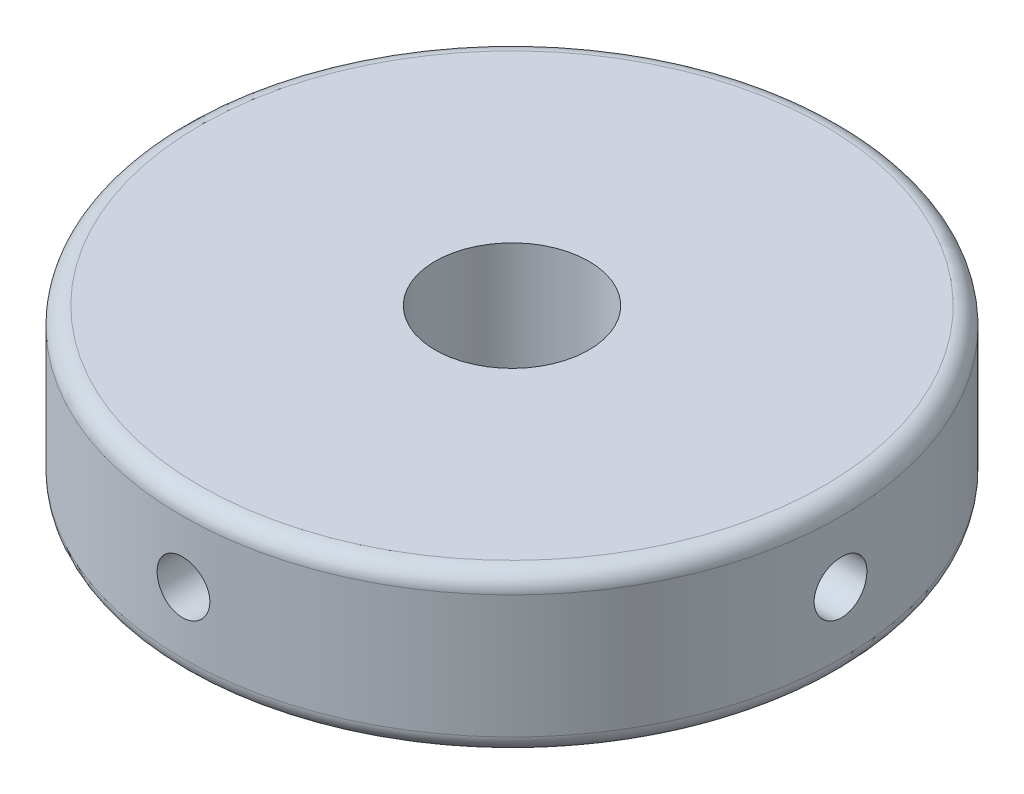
from build123d import *

# Parameters (mm, degrees)
ESQUISSE1_R                  = 37.5
EXTRUSION1_DEPTH             = 18
TROU_TARAUD_M20X2_51_D       = 17.5
R_P_TITION_CIRCULAIRE1_COUNT = 4
CONG_2_R                     = 2


with BuildPart() as part:
    # Esquisse1 → Extrusion1 (new body)
    with BuildSketch(Plane(origin=(0, 0, 0), x_dir=(1, 0, 0), z_dir=(0, 1, 0))):
        with Locations(Location((0, 0, 0), (0, 0, 270))):
            Circle(ESQUISSE1_R)
    extrude(amount=EXTRUSION1_DEPTH)

    # Trou taraud_ M20x2.51 (through all)
    with Locations(Plane(origin=(0, 0, 0), x_dir=(0, 0, -1), z_dir=(0, -1, 0))):
        with Locations((0, 0)):
            Hole(TROU_TARAUD_M20X2_51_D / 2)

    # Esquisse5 → Diam_tre du per_age _6.0 _6_1 (revolve, cut)
    with BuildSketch(Plane(origin=(-37.5, 9, 0), x_dir=(0, 0, 1), z_dir=(0, 1, 0))):
        Polygon((0, 0), (0, 11.802581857), (3, 10), (3, 0), align=None)
    diam_tre_du_per_age_6_0_6_1 = revolve(axis=Axis((-43.85, 9, 0), (1, 0, 0)), mode=Mode.SUBTRACT)

    # R_p_tition circulaire1: Diam_tre du per_age _6.0 _6_1 ×4 about axis
    r_p_tition_circulaire1_axis = Axis((0, 0, 0), (0, 1, 0))
    for i in range(1, R_P_TITION_CIRCULAIRE1_COUNT):
        add(diam_tre_du_per_age_6_0_6_1.rotate(r_p_tition_circulaire1_axis, i * 360 / R_P_TITION_CIRCULAIRE1_COUNT), mode=Mode.SUBTRACT)

    # Cong_2
    cong_2_edges = [part.edges().sort_by_distance(p)[0] for p in [
        (0, 0, -37.5),
        (0, 18, -37.5),
    ]]
    fillet(cong_2_edges, radius=CONG_2_R)


solid = part.part
